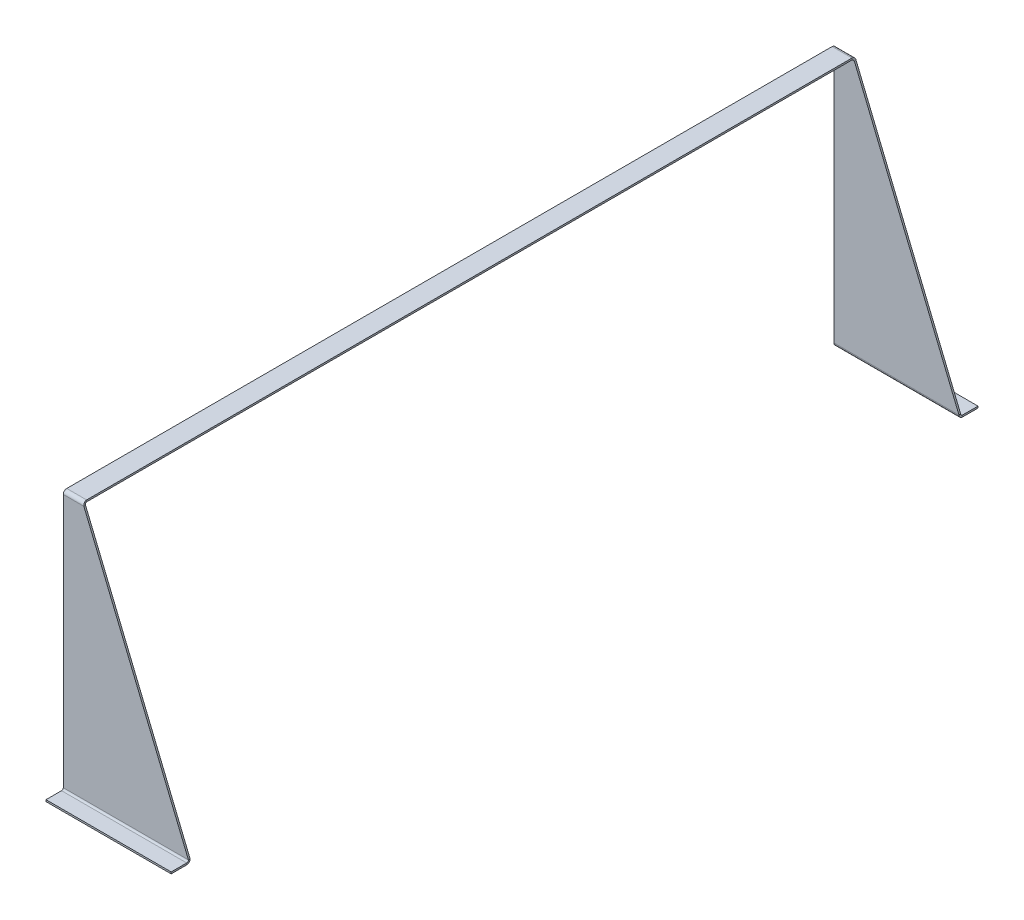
ISO-10303-21;
HEADER;
FILE_DESCRIPTION(('STEP AP214'),'2;1');
FILE_NAME('part.step','',(''),(''),'','','');
FILE_SCHEMA(('AUTOMOTIVE_DESIGN { 1 0 10303 214 1 1 1 1 }'));
ENDSEC;
DATA;
#1=APPLICATION_CONTEXT('core data for automotive mechanical design processes');
#2=APPLICATION_PROTOCOL_DEFINITION('international standard','automotive_design',2000,#1);
#3=PRODUCT_CONTEXT('',#1,'mechanical');
#4=PRODUCT('Part','Part','',(#3));
#5=PRODUCT_RELATED_PRODUCT_CATEGORY('part','',(#4));
#6=PRODUCT_DEFINITION_FORMATION('','',#4);
#7=PRODUCT_DEFINITION_CONTEXT('part definition',#1,'design');
#8=PRODUCT_DEFINITION('design','',#6,#7);
#9=PRODUCT_DEFINITION_SHAPE('','',#8);
#10=(LENGTH_UNIT() NAMED_UNIT(*) SI_UNIT(.MILLI.,.METRE.));
#11=(NAMED_UNIT(*) PLANE_ANGLE_UNIT() SI_UNIT($,.RADIAN.));
#12=(NAMED_UNIT(*) SI_UNIT($,.STERADIAN.) SOLID_ANGLE_UNIT());
#13=UNCERTAINTY_MEASURE_WITH_UNIT(LENGTH_MEASURE(1.E-05),#10,'distance_accuracy_value','');
#14=(GEOMETRIC_REPRESENTATION_CONTEXT(3) GLOBAL_UNCERTAINTY_ASSIGNED_CONTEXT((#13)) GLOBAL_UNIT_ASSIGNED_CONTEXT((#10,
#11,#12)) REPRESENTATION_CONTEXT('',''));
#15=CARTESIAN_POINT('',(0.,0.,0.));
#16=DIRECTION('',(0.,0.,1.));
#17=DIRECTION('',(1.,0.,0.));
#18=AXIS2_PLACEMENT_3D('',#15,#16,#17);
#19=CARTESIAN_POINT('',(-26.9151478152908,93.9999999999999,444.999999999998));
#20=DIRECTION('',(-0.999999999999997,0.,0.));
#21=DIRECTION('',(0.,0.,-0.999999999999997));
#22=AXIS2_PLACEMENT_3D('',#19,#20,#21);
#23=PLANE('',#22);
#24=DIRECTION('',(0.,1.,0.));
#25=VECTOR('',#24,1.);
#26=CARTESIAN_POINT('',(-26.9151478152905,93.9999999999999,1.));
#27=LINE('',#26,#25);
#28=CARTESIAN_POINT('',(-26.9151478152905,93.9999999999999,1.));
#29=VERTEX_POINT('',#28);
#30=CARTESIAN_POINT('',(-26.9151478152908,94.9999999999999,1.));
#31=VERTEX_POINT('',#30);
#32=EDGE_CURVE('E13',#29,#31,#27,.T.);
#33=ORIENTED_EDGE('',*,*,#32,.F.);
#34=DIRECTION('',(0.,0.,-0.999999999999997));
#35=VECTOR('',#34,1.);
#36=CARTESIAN_POINT('',(-26.9151478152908,93.9999999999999,444.999999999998));
#37=LINE('',#36,#35);
#38=CARTESIAN_POINT('',(-26.9151478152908,93.9999999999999,443.999999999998));
#39=VERTEX_POINT('',#38);
#40=EDGE_CURVE('E371',#39,#29,#37,.T.);
#41=ORIENTED_EDGE('',*,*,#40,.F.);
#42=DIRECTION('',(0.,1.,0.));
#43=VECTOR('',#42,1.);
#44=CARTESIAN_POINT('',(-26.9151478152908,93.9999999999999,443.999999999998));
#45=LINE('',#44,#43);
#46=CARTESIAN_POINT('',(-26.9151478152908,94.9999999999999,443.999999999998));
#47=VERTEX_POINT('',#46);
#48=EDGE_CURVE('E84',#39,#47,#45,.T.);
#49=ORIENTED_EDGE('',*,*,#48,.T.);
#50=DIRECTION('',(0.,0.,-0.999999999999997));
#51=VECTOR('',#50,1.);
#52=CARTESIAN_POINT('',(-26.9151478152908,94.9999999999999,444.999999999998));
#53=LINE('',#52,#51);
#54=EDGE_CURVE('E345',#47,#31,#53,.T.);
#55=ORIENTED_EDGE('',*,*,#54,.T.);
#56=EDGE_LOOP('',(#33,#41,#49,#55));
#57=FACE_BOUND('',#56,.T.);
#58=ADVANCED_FACE('F74',(#57),#23,.T.);
#59=CARTESIAN_POINT('',(-26.9151478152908,92.9999999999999,443.999999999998));
#60=DIRECTION('',(-0.999999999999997,0.,0.));
#61=DIRECTION('',(0.,-1.,0.));
#62=AXIS2_PLACEMENT_3D('',#59,#60,#61);
#63=PLANE('',#62);
#64=ORIENTED_EDGE('',*,*,#48,.F.);
#65=CARTESIAN_POINT('',(-26.9151478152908,92.9999999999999,443.999999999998));
#66=DIRECTION('',(0.999999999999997,0.,0.));
#67=DIRECTION('',(0.,1.,0.));
#68=AXIS2_PLACEMENT_3D('',#65,#66,#67);
#69=CIRCLE('',#68,1.);
#70=CARTESIAN_POINT('',(-26.9151478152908,92.9999999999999,444.999999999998));
#71=VERTEX_POINT('',#70);
#72=EDGE_CURVE('E309',#39,#71,#69,.T.);
#73=ORIENTED_EDGE('',*,*,#72,.T.);
#74=DIRECTION('',(0.,0.,0.999999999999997));
#75=VECTOR('',#74,1.);
#76=CARTESIAN_POINT('',(-26.9151478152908,92.9999999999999,444.999999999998));
#77=LINE('',#76,#75);
#78=CARTESIAN_POINT('',(-26.9151478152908,92.9999999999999,445.999999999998));
#79=VERTEX_POINT('',#78);
#80=EDGE_CURVE('E421',#71,#79,#77,.T.);
#81=ORIENTED_EDGE('',*,*,#80,.T.);
#82=CARTESIAN_POINT('',(-26.9151478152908,92.9999999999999,443.999999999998));
#83=DIRECTION('',(-0.999999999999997,0.,0.));
#84=DIRECTION('',(0.,0.,0.999999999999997));
#85=AXIS2_PLACEMENT_3D('',#82,#83,#84);
#86=CIRCLE('',#85,2.);
#87=EDGE_CURVE('E349',#47,#79,#86,.F.);
#88=ORIENTED_EDGE('',*,*,#87,.F.);
#89=EDGE_LOOP('',(#64,#73,#81,#88));
#90=FACE_BOUND('',#89,.T.);
#91=ADVANCED_FACE('F424',(#90),#63,.T.);
#92=CARTESIAN_POINT('',(-26.9151478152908,93.9999999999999,444.999999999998));
#93=DIRECTION('',(0.999999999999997,0.,0.));
#94=DIRECTION('',(0.,-1.,0.));
#95=AXIS2_PLACEMENT_3D('',#92,#93,#94);
#96=PLANE('',#95);
#97=ORIENTED_EDGE('',*,*,#80,.F.);
#98=DIRECTION('',(0.,-1.,0.));
#99=VECTOR('',#98,1.);
#100=CARTESIAN_POINT('',(-26.9151478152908,93.9999999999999,444.999999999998));
#101=LINE('',#100,#99);
#102=CARTESIAN_POINT('',(-26.9151478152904,-53.9999999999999,444.999999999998));
#103=VERTEX_POINT('',#102);
#104=EDGE_CURVE('E368',#71,#103,#101,.T.);
#105=ORIENTED_EDGE('',*,*,#104,.T.);
#106=DIRECTION('',(0.,0.,0.999999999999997));
#107=VECTOR('',#106,1.);
#108=CARTESIAN_POINT('',(-26.9151478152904,-53.9999999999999,444.999999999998));
#109=LINE('',#108,#107);
#110=CARTESIAN_POINT('',(-26.9151478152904,-53.9999999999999,445.999999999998));
#111=VERTEX_POINT('',#110);
#112=EDGE_CURVE('E419',#103,#111,#109,.T.);
#113=ORIENTED_EDGE('',*,*,#112,.T.);
#114=DIRECTION('',(0.,1.,0.));
#115=VECTOR('',#114,1.);
#116=CARTESIAN_POINT('',(-26.9151478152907,1.11022302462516E-13,445.999999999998));
#117=LINE('',#116,#115);
#118=EDGE_CURVE('E352',#79,#111,#117,.F.);
#119=ORIENTED_EDGE('',*,*,#118,.F.);
#120=EDGE_LOOP('',(#97,#105,#113,#119));
#121=FACE_BOUND('',#120,.T.);
#122=ADVANCED_FACE('F432',(#121),#96,.F.);
#123=CARTESIAN_POINT('',(-15.4151478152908,93.9999999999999,444.999999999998));
#124=DIRECTION('',(-0.92467809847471,-0.380749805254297,0.));
#125=DIRECTION('',(-0.380749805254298,0.924678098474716,0.));
#126=AXIS2_PLACEMENT_3D('',#123,#124,#125);
#127=PLANE('',#126);
#128=DIRECTION('',(0.,0.,0.999999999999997));
#129=VECTOR('',#128,1.);
#130=CARTESIAN_POINT('',(45.526028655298,-53.9999999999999,444.999999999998));
#131=LINE('',#130,#129);
#132=CARTESIAN_POINT('',(45.526028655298,-53.9999999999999,444.999999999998));
#133=VERTEX_POINT('',#132);
#134=CARTESIAN_POINT('',(45.526028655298,-53.9999999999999,445.999999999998));
#135=VERTEX_POINT('',#134);
#136=EDGE_CURVE('E416',#133,#135,#131,.T.);
#137=ORIENTED_EDGE('',*,*,#136,.F.);
#138=DIRECTION('',(-0.380749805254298,0.924678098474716,0.));
#139=VECTOR('',#138,1.);
#140=CARTESIAN_POINT('',(-15.4151478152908,93.9999999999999,444.999999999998));
#141=LINE('',#140,#139);
#142=CARTESIAN_POINT('',(-15.0033831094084,92.9999999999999,444.999999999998));
#143=VERTEX_POINT('',#142);
#144=EDGE_CURVE('E364',#133,#143,#141,.T.);
#145=ORIENTED_EDGE('',*,*,#144,.T.);
#146=DIRECTION('',(0.,0.,0.999999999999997));
#147=VECTOR('',#146,1.);
#148=CARTESIAN_POINT('',(-15.0033831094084,92.9999999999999,444.999999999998));
#149=LINE('',#148,#147);
#150=CARTESIAN_POINT('',(-15.0033831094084,92.9999999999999,445.999999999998));
#151=VERTEX_POINT('',#150);
#152=EDGE_CURVE('E414',#143,#151,#149,.T.);
#153=ORIENTED_EDGE('',*,*,#152,.T.);
#154=DIRECTION('',(-0.380749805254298,0.924678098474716,0.));
#155=VECTOR('',#154,1.);
#156=CARTESIAN_POINT('',(-15.4151478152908,93.9999999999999,445.999999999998));
#157=LINE('',#156,#155);
#158=EDGE_CURVE('E350',#135,#151,#157,.T.);
#159=ORIENTED_EDGE('',*,*,#158,.F.);
#160=EDGE_LOOP('',(#137,#145,#153,#159));
#161=FACE_BOUND('',#160,.T.);
#162=ADVANCED_FACE('F510',(#161),#127,.F.);
#163=CARTESIAN_POINT('',(-15.415147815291,94.9999999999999,443.999999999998));
#164=CARTESIAN_POINT('',(-15.415147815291,94.6666666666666,443.999999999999));
#165=CARTESIAN_POINT('',(-15.4151478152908,94.3333333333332,443.999999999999));
#166=CARTESIAN_POINT('',(-15.4151478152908,93.9999999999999,443.999999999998));
#167=CARTESIAN_POINT('',(-15.4151478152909,95.,439.999999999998));
#168=CARTESIAN_POINT('',(-15.415147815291,94.6666666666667,440.666666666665));
#169=CARTESIAN_POINT('',(-15.415147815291,94.3333333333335,441.333333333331));
#170=CARTESIAN_POINT('',(-15.4151478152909,94.0000000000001,441.999999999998));
#171=CARTESIAN_POINT('',(-14.5916184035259,91.,439.999999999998));
#172=CARTESIAN_POINT('',(-14.5916184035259,91.3333333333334,440.666666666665));
#173=CARTESIAN_POINT('',(-14.5916184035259,91.6666666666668,441.333333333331));
#174=CARTESIAN_POINT('',(-14.5916184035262,92.0000000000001,441.999999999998));
#175=CARTESIAN_POINT('',(-14.591618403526,90.9999999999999,443.999999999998));
#176=CARTESIAN_POINT('',(-14.591618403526,91.3333333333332,443.999999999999));
#177=CARTESIAN_POINT('',(-14.591618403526,91.6666666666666,443.999999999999));
#178=CARTESIAN_POINT('',(-14.591618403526,91.9999999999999,443.999999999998));
#179=CARTESIAN_POINT('',(-14.5916184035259,91.0000000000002,447.999999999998));
#180=CARTESIAN_POINT('',(-14.5916184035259,91.3333333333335,447.333333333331));
#181=CARTESIAN_POINT('',(-14.5916184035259,91.6666666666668,446.666666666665));
#182=CARTESIAN_POINT('',(-14.5916184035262,92.0000000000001,445.999999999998));
#183=CARTESIAN_POINT('',(-15.4151478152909,95.0000000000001,447.999999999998));
#184=CARTESIAN_POINT('',(-15.415147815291,94.6666666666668,447.333333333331));
#185=CARTESIAN_POINT('',(-15.415147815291,94.3333333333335,446.666666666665));
#186=CARTESIAN_POINT('',(-15.4151478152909,94.0000000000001,445.999999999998));
#187=CARTESIAN_POINT('',(-15.415147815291,94.9999999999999,443.999999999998));
#188=CARTESIAN_POINT('',(-15.415147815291,94.6666666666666,443.999999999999));
#189=CARTESIAN_POINT('',(-15.4151478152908,94.3333333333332,443.999999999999));
#190=CARTESIAN_POINT('',(-15.4151478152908,93.9999999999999,443.999999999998));
#191=(BOUNDED_SURFACE() B_SPLINE_SURFACE(3,3,((#163,#164,#165,#166),(#167,#168,#169,#170),(#171,
#172,#173,#174),(#175,#176,#177,#178),(#179,#180,#181,#182),(#183,#184,#185,#186),(#187,#188,
#189,#190)),.UNSPECIFIED.,.T.,.F.,.F.) B_SPLINE_SURFACE_WITH_KNOTS((4,3,4),(4,4),(0.,0.5,1.),
(0.,1.),.UNSPECIFIED.) GEOMETRIC_REPRESENTATION_ITEM() RATIONAL_B_SPLINE_SURFACE(((1.,1.,1.,1.),
(0.333333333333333,0.333333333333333,0.333333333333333,0.333333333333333),(0.333333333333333,
0.333333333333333,0.333333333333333,0.333333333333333),(1.,1.,1.,1.),(0.333333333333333,
0.333333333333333,0.333333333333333,0.333333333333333),(0.333333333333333,0.333333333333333,
0.333333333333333,0.333333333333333),(1.,1.,1.,1.))) REPRESENTATION_ITEM('') SURFACE());
#192=CARTESIAN_POINT('',(-15.0033831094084,92.9999999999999,443.999999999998));
#193=DIRECTION('',(0.92467809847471,0.380749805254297,0.));
#194=DIRECTION('',(-0.380749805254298,0.924678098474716,0.));
#195=AXIS2_PLACEMENT_3D('',#192,#193,#194);
#196=ELLIPSE('',#195,1.08145743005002,1.);
#197=CARTESIAN_POINT('',(-15.4151478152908,93.9999999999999,443.999999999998));
#198=VERTEX_POINT('',#197);
#199=EDGE_CURVE('E395',#143,#198,#196,.F.);
#200=DIRECTION('',(0.,1.,0.));
#201=VECTOR('',#200,1.);
#202=CARTESIAN_POINT('',(-15.4151478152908,93.9999999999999,443.999999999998));
#203=LINE('',#202,#201);
#204=CARTESIAN_POINT('',(-15.415147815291,94.9999999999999,443.999999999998));
#205=VERTEX_POINT('',#204);
#206=EDGE_CURVE('E136',#198,#205,#203,.T.);
#207=CARTESIAN_POINT('',(-15.0033831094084,92.9999999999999,443.999999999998));
#208=DIRECTION('',(0.979457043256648,0.201652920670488,0.));
#209=DIRECTION('',(-0.20165292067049,0.979457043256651,0.));
#210=AXIS2_PLACEMENT_3D('',#207,#208,#209);
#211=ELLIPSE('',#210,2.04194764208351,2.);
#212=EDGE_CURVE('E346',#151,#205,#211,.F.);
#213=ORIENTED_EDGE('',*,*,#152,.F.);
#214=ORIENTED_EDGE('',*,*,#199,.T.);
#215=ORIENTED_EDGE('',*,*,#206,.T.);
#216=ORIENTED_EDGE('',*,*,#212,.F.);
#217=EDGE_LOOP('',(#213,#214,#215,#216));
#218=FACE_BOUND('',#217,.T.);
#219=ADVANCED_FACE('F439',(#218),#191,.F.);
#220=CARTESIAN_POINT('',(-15.4151478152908,93.9999999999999,444.999999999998));
#221=DIRECTION('',(-0.999999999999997,0.,0.));
#222=DIRECTION('',(0.,0.,-0.999999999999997));
#223=AXIS2_PLACEMENT_3D('',#220,#221,#222);
#224=PLANE('',#223);
#225=ORIENTED_EDGE('',*,*,#206,.F.);
#226=DIRECTION('',(0.,0.,-0.999999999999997));
#227=VECTOR('',#226,1.);
#228=CARTESIAN_POINT('',(-15.4151478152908,93.9999999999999,444.999999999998));
#229=LINE('',#228,#227);
#230=CARTESIAN_POINT('',(-15.4151478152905,94.,1.));
#231=VERTEX_POINT('',#230);
#232=EDGE_CURVE('E374',#198,#231,#229,.T.);
#233=ORIENTED_EDGE('',*,*,#232,.T.);
#234=DIRECTION('',(0.,1.,0.));
#235=VECTOR('',#234,1.);
#236=CARTESIAN_POINT('',(-15.4151478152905,94.,1.));
#237=LINE('',#236,#235);
#238=CARTESIAN_POINT('',(-15.4151478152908,95.,1.));
#239=VERTEX_POINT('',#238);
#240=EDGE_CURVE('E411',#231,#239,#237,.T.);
#241=ORIENTED_EDGE('',*,*,#240,.T.);
#242=DIRECTION('',(0.,0.,-0.999999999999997));
#243=VECTOR('',#242,1.);
#244=CARTESIAN_POINT('',(-15.415147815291,94.9999999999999,444.999999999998));
#245=LINE('',#244,#243);
#246=EDGE_CURVE('E336',#205,#239,#245,.T.);
#247=ORIENTED_EDGE('',*,*,#246,.F.);
#248=EDGE_LOOP('',(#225,#233,#241,#247));
#249=FACE_BOUND('',#248,.T.);
#250=ADVANCED_FACE('F441',(#249),#224,.F.);
#251=CARTESIAN_POINT('',(-14.5916184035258,92.,1.));
#252=CARTESIAN_POINT('',(-14.5916184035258,91.6666666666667,1.));
#253=CARTESIAN_POINT('',(-14.5916184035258,91.3333333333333,1.));
#254=CARTESIAN_POINT('',(-14.5916184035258,91.,1.));
#255=CARTESIAN_POINT('',(-14.5916184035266,92.,2.99999999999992));
#256=CARTESIAN_POINT('',(-14.5916184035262,91.6666666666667,3.66666666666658));
#257=CARTESIAN_POINT('',(-14.5916184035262,91.3333333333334,4.33333333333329));
#258=CARTESIAN_POINT('',(-14.5916184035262,91.0000000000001,4.99999999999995));
#259=CARTESIAN_POINT('',(-15.4151478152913,94.,2.99999999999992));
#260=CARTESIAN_POINT('',(-15.4151478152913,94.3333333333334,3.66666666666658));
#261=CARTESIAN_POINT('',(-15.4151478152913,94.6666666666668,4.33333333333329));
#262=CARTESIAN_POINT('',(-15.4151478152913,95.0000000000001,4.99999999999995));
#263=CARTESIAN_POINT('',(-15.4151478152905,94.,1.));
#264=CARTESIAN_POINT('',(-15.4151478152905,94.3333333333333,1.));
#265=CARTESIAN_POINT('',(-15.4151478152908,94.6666666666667,1.));
#266=CARTESIAN_POINT('',(-15.4151478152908,95.,1.));
#267=CARTESIAN_POINT('',(-15.4151478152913,94.,-1.00000000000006));
#268=CARTESIAN_POINT('',(-15.4151478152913,94.3333333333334,-1.66666666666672));
#269=CARTESIAN_POINT('',(-15.4151478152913,94.6666666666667,-2.33333333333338));
#270=CARTESIAN_POINT('',(-15.4151478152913,95.,-3.00000000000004));
#271=CARTESIAN_POINT('',(-14.5916184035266,92.,-1.00000000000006));
#272=CARTESIAN_POINT('',(-14.5916184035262,91.6666666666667,-1.66666666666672));
#273=CARTESIAN_POINT('',(-14.5916184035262,91.3333333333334,-2.33333333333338));
#274=CARTESIAN_POINT('',(-14.5916184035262,91.,-3.00000000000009));
#275=CARTESIAN_POINT('',(-14.5916184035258,92.,1.));
#276=CARTESIAN_POINT('',(-14.5916184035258,91.6666666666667,1.));
#277=CARTESIAN_POINT('',(-14.5916184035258,91.3333333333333,1.));
#278=CARTESIAN_POINT('',(-14.5916184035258,91.,1.));
#279=(BOUNDED_SURFACE() B_SPLINE_SURFACE(3,3,((#251,#252,#253,#254),(#255,#256,#257,#258),(#259,
#260,#261,#262),(#263,#264,#265,#266),(#267,#268,#269,#270),(#271,#272,#273,#274),(#275,#276,
#277,#278)),.UNSPECIFIED.,.T.,.F.,.F.) B_SPLINE_SURFACE_WITH_KNOTS((4,3,4),(4,4),(0.,0.5,1.),
(0.,1.),.UNSPECIFIED.) GEOMETRIC_REPRESENTATION_ITEM() RATIONAL_B_SPLINE_SURFACE(((1.,1.,1.,1.),
(0.333333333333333,0.333333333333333,0.333333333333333,0.333333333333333),(0.333333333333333,
0.333333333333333,0.333333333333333,0.333333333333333),(1.,1.,1.,1.),(0.333333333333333,
0.333333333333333,0.333333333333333,0.333333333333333),(0.333333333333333,0.333333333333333,
0.333333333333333,0.333333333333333),(1.,1.,1.,1.))) REPRESENTATION_ITEM('') SURFACE());
#280=CARTESIAN_POINT('',(-15.0033831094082,93.,1.));
#281=DIRECTION('',(-0.92467809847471,-0.380749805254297,0.));
#282=DIRECTION('',(0.380749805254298,-0.924678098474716,0.));
#283=AXIS2_PLACEMENT_3D('',#280,#281,#282);
#284=ELLIPSE('',#283,1.08145743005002,1.);
#285=CARTESIAN_POINT('',(-15.0033831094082,93.,0.));
#286=VERTEX_POINT('',#285);
#287=EDGE_CURVE('E365',#231,#286,#284,.T.);
#288=DIRECTION('',(0.,0.,-0.999999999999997));
#289=VECTOR('',#288,1.);
#290=CARTESIAN_POINT('',(-15.0033831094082,93.,0.));
#291=LINE('',#290,#289);
#292=CARTESIAN_POINT('',(-15.0033831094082,93.,-1.));
#293=VERTEX_POINT('',#292);
#294=EDGE_CURVE('E409',#286,#293,#291,.T.);
#295=CARTESIAN_POINT('',(-15.0033831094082,93.,1.));
#296=DIRECTION('',(-0.979457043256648,-0.201652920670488,0.));
#297=DIRECTION('',(0.20165292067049,-0.979457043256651,0.));
#298=AXIS2_PLACEMENT_3D('',#295,#296,#297);
#299=ELLIPSE('',#298,2.04194764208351,2.);
#300=EDGE_CURVE('E339',#239,#293,#299,.T.);
#301=ORIENTED_EDGE('',*,*,#240,.F.);
#302=ORIENTED_EDGE('',*,*,#287,.T.);
#303=ORIENTED_EDGE('',*,*,#294,.T.);
#304=ORIENTED_EDGE('',*,*,#300,.F.);
#305=EDGE_LOOP('',(#301,#302,#303,#304));
#306=FACE_BOUND('',#305,.T.);
#307=ADVANCED_FACE('F465',(#306),#279,.T.);
#308=CARTESIAN_POINT('',(-15.4151478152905,94.,0.));
#309=DIRECTION('',(-0.92467809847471,-0.380749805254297,0.));
#310=DIRECTION('',(-0.380749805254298,0.924678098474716,0.));
#311=AXIS2_PLACEMENT_3D('',#308,#309,#310);
#312=PLANE('',#311);
#313=ORIENTED_EDGE('',*,*,#294,.F.);
#314=DIRECTION('',(-0.380749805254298,0.924678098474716,0.));
#315=VECTOR('',#314,1.);
#316=CARTESIAN_POINT('',(-15.4151478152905,94.,0.));
#317=LINE('',#316,#315);
#318=CARTESIAN_POINT('',(45.5260286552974,-54.0000000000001,0.));
#319=VERTEX_POINT('',#318);
#320=EDGE_CURVE('E382',#319,#286,#317,.T.);
#321=ORIENTED_EDGE('',*,*,#320,.F.);
#322=DIRECTION('',(0.,0.,-0.999999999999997));
#323=VECTOR('',#322,1.);
#324=CARTESIAN_POINT('',(45.5260286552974,-54.0000000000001,0.));
#325=LINE('',#324,#323);
#326=CARTESIAN_POINT('',(45.5260286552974,-54.0000000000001,-1.00000000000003));
#327=VERTEX_POINT('',#326);
#328=EDGE_CURVE('E406',#319,#327,#325,.T.);
#329=ORIENTED_EDGE('',*,*,#328,.T.);
#330=DIRECTION('',(-0.380749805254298,0.924678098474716,0.));
#331=VECTOR('',#330,1.);
#332=CARTESIAN_POINT('',(-15.4151478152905,93.9999999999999,-1.));
#333=LINE('',#332,#331);
#334=EDGE_CURVE('E325',#327,#293,#333,.T.);
#335=ORIENTED_EDGE('',*,*,#334,.T.);
#336=EDGE_LOOP('',(#313,#321,#329,#335));
#337=FACE_BOUND('',#336,.T.);
#338=ADVANCED_FACE('F493',(#337),#312,.F.);
#339=CARTESIAN_POINT('',(-26.9151478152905,93.9999999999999,0.));
#340=DIRECTION('',(0.999999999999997,0.,0.));
#341=DIRECTION('',(0.,-1.,0.));
#342=AXIS2_PLACEMENT_3D('',#339,#340,#341);
#343=PLANE('',#342);
#344=DIRECTION('',(0.,0.,-0.999999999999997));
#345=VECTOR('',#344,1.);
#346=CARTESIAN_POINT('',(-26.9151478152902,-54.,0.));
#347=LINE('',#346,#345);
#348=CARTESIAN_POINT('',(-26.9151478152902,-54.,0.));
#349=VERTEX_POINT('',#348);
#350=CARTESIAN_POINT('',(-26.9151478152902,-54.,-1.00000000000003));
#351=VERTEX_POINT('',#350);
#352=EDGE_CURVE('E404',#349,#351,#347,.T.);
#353=ORIENTED_EDGE('',*,*,#352,.F.);
#354=DIRECTION('',(0.,-1.,0.));
#355=VECTOR('',#354,1.);
#356=CARTESIAN_POINT('',(-26.9151478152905,93.9999999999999,0.));
#357=LINE('',#356,#355);
#358=CARTESIAN_POINT('',(-26.9151478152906,92.9999999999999,0.));
#359=VERTEX_POINT('',#358);
#360=EDGE_CURVE('E379',#359,#349,#357,.T.);
#361=ORIENTED_EDGE('',*,*,#360,.F.);
#362=DIRECTION('',(0.,0.,-0.999999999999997));
#363=VECTOR('',#362,1.);
#364=CARTESIAN_POINT('',(-26.9151478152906,92.9999999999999,0.));
#365=LINE('',#364,#363);
#366=CARTESIAN_POINT('',(-26.9151478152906,92.9999999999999,-1.));
#367=VERTEX_POINT('',#366);
#368=EDGE_CURVE('E78',#359,#367,#365,.T.);
#369=ORIENTED_EDGE('',*,*,#368,.T.);
#370=DIRECTION('',(0.,1.,0.));
#371=VECTOR('',#370,1.);
#372=CARTESIAN_POINT('',(-26.9151478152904,0.,-1.));
#373=LINE('',#372,#371);
#374=EDGE_CURVE('E331',#367,#351,#373,.F.);
#375=ORIENTED_EDGE('',*,*,#374,.T.);
#376=EDGE_LOOP('',(#353,#361,#369,#375));
#377=FACE_BOUND('',#376,.T.);
#378=ADVANCED_FACE('F473',(#377),#343,.F.);
#379=CARTESIAN_POINT('',(-26.9151478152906,92.9999999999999,1.));
#380=DIRECTION('',(0.999999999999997,0.,0.));
#381=DIRECTION('',(0.,1.,0.));
#382=AXIS2_PLACEMENT_3D('',#379,#380,#381);
#383=PLANE('',#382);
#384=CARTESIAN_POINT('',(-26.9151478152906,92.9999999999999,1.));
#385=DIRECTION('',(-0.999999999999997,0.,0.));
#386=DIRECTION('',(0.,-1.,0.));
#387=AXIS2_PLACEMENT_3D('',#384,#385,#386);
#388=CIRCLE('',#387,1.);
#389=EDGE_CURVE('E392',#359,#29,#388,.F.);
#390=ORIENTED_EDGE('',*,*,#389,.T.);
#391=ORIENTED_EDGE('',*,*,#32,.T.);
#392=CARTESIAN_POINT('',(-26.9151478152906,92.9999999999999,1.));
#393=DIRECTION('',(0.999999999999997,0.,0.));
#394=DIRECTION('',(0.,0.,-0.999999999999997));
#395=AXIS2_PLACEMENT_3D('',#392,#393,#394);
#396=CIRCLE('',#395,2.);
#397=EDGE_CURVE('E342',#367,#31,#396,.T.);
#398=ORIENTED_EDGE('',*,*,#397,.F.);
#399=ORIENTED_EDGE('',*,*,#368,.F.);
#400=EDGE_LOOP('',(#390,#391,#398,#399));
#401=FACE_BOUND('',#400,.T.);
#402=ADVANCED_FACE('F76',(#401),#383,.F.);
#403=CARTESIAN_POINT('',(0.,0.,-1.));
#404=DIRECTION('',(0.,0.,-0.999999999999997));
#405=DIRECTION('',(-0.999999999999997,0.,0.));
#406=AXIS2_PLACEMENT_3D('',#403,#404,#405);
#407=PLANE('',#406);
#408=ORIENTED_EDGE('',*,*,#374,.F.);
#409=DIRECTION('',(-0.999999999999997,0.,0.));
#410=VECTOR('',#409,1.);
#411=CARTESIAN_POINT('',(-1.11022302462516E-13,93.,-1.));
#412=LINE('',#411,#410);
#413=EDGE_CURVE('E318',#367,#293,#412,.F.);
#414=ORIENTED_EDGE('',*,*,#413,.T.);
#415=ORIENTED_EDGE('',*,*,#334,.F.);
#416=DIRECTION('',(-0.999999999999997,0.,0.));
#417=VECTOR('',#416,1.);
#418=CARTESIAN_POINT('',(-6.66133814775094E-13,-54.,-1.));
#419=LINE('',#418,#417);
#420=EDGE_CURVE('E334',#351,#327,#419,.F.);
#421=ORIENTED_EDGE('',*,*,#420,.F.);
#422=EDGE_LOOP('',(#408,#414,#415,#421));
#423=FACE_BOUND('',#422,.T.);
#424=ADVANCED_FACE('F470',(#423),#407,.T.);
#425=CARTESIAN_POINT('',(-15.415147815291,94.9999999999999,444.999999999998));
#426=DIRECTION('',(0.,-1.,0.));
#427=DIRECTION('',(0.,0.,-0.999999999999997));
#428=AXIS2_PLACEMENT_3D('',#425,#426,#427);
#429=PLANE('',#428);
#430=ORIENTED_EDGE('',*,*,#54,.F.);
#431=DIRECTION('',(0.999999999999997,0.,0.));
#432=VECTOR('',#431,1.);
#433=CARTESIAN_POINT('',(-15.415147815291,94.9999999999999,443.999999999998));
#434=LINE('',#433,#432);
#435=EDGE_CURVE('E326',#47,#205,#434,.T.);
#436=ORIENTED_EDGE('',*,*,#435,.T.);
#437=ORIENTED_EDGE('',*,*,#246,.T.);
#438=DIRECTION('',(0.999999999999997,0.,0.));
#439=VECTOR('',#438,1.);
#440=CARTESIAN_POINT('',(-15.4151478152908,95.,1.));
#441=LINE('',#440,#439);
#442=EDGE_CURVE('E322',#239,#31,#441,.F.);
#443=ORIENTED_EDGE('',*,*,#442,.T.);
#444=EDGE_LOOP('',(#430,#436,#437,#443));
#445=FACE_BOUND('',#444,.T.);
#446=ADVANCED_FACE('F444',(#445),#429,.F.);
#447=CARTESIAN_POINT('',(4.44089209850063E-13,0.,445.999999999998));
#448=DIRECTION('',(0.,0.,-0.999999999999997));
#449=DIRECTION('',(-0.999999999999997,0.,0.));
#450=AXIS2_PLACEMENT_3D('',#447,#448,#449);
#451=PLANE('',#450);
#452=ORIENTED_EDGE('',*,*,#158,.T.);
#453=DIRECTION('',(-0.999999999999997,0.,0.));
#454=VECTOR('',#453,1.);
#455=CARTESIAN_POINT('',(0.,93.,445.999999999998));
#456=LINE('',#455,#454);
#457=EDGE_CURVE('E321',#151,#79,#456,.T.);
#458=ORIENTED_EDGE('',*,*,#457,.T.);
#459=ORIENTED_EDGE('',*,*,#118,.T.);
#460=DIRECTION('',(-0.999999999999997,0.,0.));
#461=VECTOR('',#460,1.);
#462=CARTESIAN_POINT('',(0.,-53.9999999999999,445.999999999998));
#463=LINE('',#462,#461);
#464=EDGE_CURVE('E149',#111,#135,#463,.F.);
#465=ORIENTED_EDGE('',*,*,#464,.T.);
#466=EDGE_LOOP('',(#452,#458,#459,#465));
#467=FACE_BOUND('',#466,.T.);
#468=ADVANCED_FACE('F434',(#467),#451,.F.);
#469=CARTESIAN_POINT('',(-15.4151478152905,93.,1.));
#470=DIRECTION('',(0.999999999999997,0.,0.));
#471=DIRECTION('',(0.,0.,-0.999999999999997));
#472=AXIS2_PLACEMENT_3D('',#469,#470,#471);
#473=CYLINDRICAL_SURFACE('',#472,2.);
#474=ORIENTED_EDGE('',*,*,#300,.T.);
#475=ORIENTED_EDGE('',*,*,#413,.F.);
#476=ORIENTED_EDGE('',*,*,#397,.T.);
#477=ORIENTED_EDGE('',*,*,#442,.F.);
#478=EDGE_LOOP('',(#474,#475,#476,#477));
#479=FACE_BOUND('',#478,.T.);
#480=ADVANCED_FACE('F467',(#479),#473,.T.);
#481=CARTESIAN_POINT('',(0.,93.,443.999999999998));
#482=DIRECTION('',(-0.999999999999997,0.,0.));
#483=DIRECTION('',(0.,0.,0.999999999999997));
#484=AXIS2_PLACEMENT_3D('',#481,#482,#483);
#485=CYLINDRICAL_SURFACE('',#484,2.);
#486=ORIENTED_EDGE('',*,*,#212,.T.);
#487=ORIENTED_EDGE('',*,*,#435,.F.);
#488=ORIENTED_EDGE('',*,*,#87,.T.);
#489=ORIENTED_EDGE('',*,*,#457,.F.);
#490=EDGE_LOOP('',(#486,#487,#488,#489));
#491=FACE_BOUND('',#490,.T.);
#492=ADVANCED_FACE('F431',(#491),#485,.T.);
#493=CARTESIAN_POINT('',(0.,0.,0.));
#494=DIRECTION('',(0.,0.,-0.999999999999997));
#495=DIRECTION('',(-0.999999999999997,0.,0.));
#496=AXIS2_PLACEMENT_3D('',#493,#494,#495);
#497=PLANE('',#496);
#498=ORIENTED_EDGE('',*,*,#360,.T.);
#499=DIRECTION('',(0.999999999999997,0.,0.));
#500=VECTOR('',#499,1.);
#501=CARTESIAN_POINT('',(-26.9151478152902,-54.,0.));
#502=LINE('',#501,#500);
#503=EDGE_CURVE('E376',#349,#319,#502,.T.);
#504=ORIENTED_EDGE('',*,*,#503,.T.);
#505=ORIENTED_EDGE('',*,*,#320,.T.);
#506=DIRECTION('',(-0.999999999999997,0.,0.));
#507=VECTOR('',#506,1.);
#508=CARTESIAN_POINT('',(-15.4151478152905,93.,0.));
#509=LINE('',#508,#507);
#510=EDGE_CURVE('E388',#359,#286,#509,.F.);
#511=ORIENTED_EDGE('',*,*,#510,.F.);
#512=EDGE_LOOP('',(#498,#504,#505,#511));
#513=FACE_BOUND('',#512,.T.);
#514=ADVANCED_FACE('F462',(#513),#497,.F.);
#515=CARTESIAN_POINT('',(-15.4151478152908,93.9999999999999,444.999999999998));
#516=DIRECTION('',(0.,-1.,0.));
#517=DIRECTION('',(0.,0.,-0.999999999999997));
#518=AXIS2_PLACEMENT_3D('',#515,#516,#517);
#519=PLANE('',#518);
#520=ORIENTED_EDGE('',*,*,#40,.T.);
#521=DIRECTION('',(-0.999999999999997,0.,0.));
#522=VECTOR('',#521,1.);
#523=CARTESIAN_POINT('',(-26.9151478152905,93.9999999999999,1.));
#524=LINE('',#523,#522);
#525=EDGE_CURVE('E385',#231,#29,#524,.T.);
#526=ORIENTED_EDGE('',*,*,#525,.F.);
#527=ORIENTED_EDGE('',*,*,#232,.F.);
#528=DIRECTION('',(-0.999999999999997,0.,0.));
#529=VECTOR('',#528,1.);
#530=CARTESIAN_POINT('',(-15.4151478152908,93.9999999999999,443.999999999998));
#531=LINE('',#530,#529);
#532=EDGE_CURVE('E357',#39,#198,#531,.F.);
#533=ORIENTED_EDGE('',*,*,#532,.F.);
#534=EDGE_LOOP('',(#520,#526,#527,#533));
#535=FACE_BOUND('',#534,.T.);
#536=ADVANCED_FACE('F456',(#535),#519,.T.);
#537=CARTESIAN_POINT('',(4.44089209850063E-13,0.,444.999999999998));
#538=DIRECTION('',(0.,0.,-0.999999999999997));
#539=DIRECTION('',(-0.999999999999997,0.,0.));
#540=AXIS2_PLACEMENT_3D('',#537,#538,#539);
#541=PLANE('',#540);
#542=ORIENTED_EDGE('',*,*,#144,.F.);
#543=DIRECTION('',(0.999999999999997,0.,0.));
#544=VECTOR('',#543,1.);
#545=CARTESIAN_POINT('',(-26.9151478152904,-53.9999999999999,444.999999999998));
#546=LINE('',#545,#544);
#547=EDGE_CURVE('E361',#103,#133,#546,.T.);
#548=ORIENTED_EDGE('',*,*,#547,.F.);
#549=ORIENTED_EDGE('',*,*,#104,.F.);
#550=DIRECTION('',(-0.999999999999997,0.,0.));
#551=VECTOR('',#550,1.);
#552=CARTESIAN_POINT('',(0.,93.,444.999999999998));
#553=LINE('',#552,#551);
#554=EDGE_CURVE('E391',#143,#71,#553,.T.);
#555=ORIENTED_EDGE('',*,*,#554,.F.);
#556=EDGE_LOOP('',(#542,#548,#549,#555));
#557=FACE_BOUND('',#556,.T.);
#558=ADVANCED_FACE('F622',(#557),#541,.T.);
#559=CARTESIAN_POINT('',(-15.4151478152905,93.,1.));
#560=DIRECTION('',(0.999999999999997,0.,0.));
#561=DIRECTION('',(0.,0.,-0.999999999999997));
#562=AXIS2_PLACEMENT_3D('',#559,#560,#561);
#563=CYLINDRICAL_SURFACE('',#562,1.);
#564=ORIENTED_EDGE('',*,*,#287,.F.);
#565=ORIENTED_EDGE('',*,*,#525,.T.);
#566=ORIENTED_EDGE('',*,*,#389,.F.);
#567=ORIENTED_EDGE('',*,*,#510,.T.);
#568=EDGE_LOOP('',(#564,#565,#566,#567));
#569=FACE_BOUND('',#568,.T.);
#570=ADVANCED_FACE('F452',(#569),#563,.F.);
#571=CARTESIAN_POINT('',(0.,93.,443.999999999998));
#572=DIRECTION('',(-0.999999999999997,0.,0.));
#573=DIRECTION('',(0.,0.,0.999999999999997));
#574=AXIS2_PLACEMENT_3D('',#571,#572,#573);
#575=CYLINDRICAL_SURFACE('',#574,1.);
#576=ORIENTED_EDGE('',*,*,#199,.F.);
#577=ORIENTED_EDGE('',*,*,#554,.T.);
#578=ORIENTED_EDGE('',*,*,#72,.F.);
#579=ORIENTED_EDGE('',*,*,#532,.T.);
#580=EDGE_LOOP('',(#576,#577,#578,#579));
#581=FACE_BOUND('',#580,.T.);
#582=ADVANCED_FACE('F639',(#581),#575,.F.);
#583=CARTESIAN_POINT('',(-26.9151478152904,-53.9999999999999,446.999999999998));
#584=DIRECTION('',(-0.999999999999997,0.,0.));
#585=DIRECTION('',(0.,0.,0.999999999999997));
#586=AXIS2_PLACEMENT_3D('',#583,#584,#585);
#587=PLANE('',#586);
#588=DIRECTION('',(0.,1.,0.));
#589=VECTOR('',#588,1.);
#590=CARTESIAN_POINT('',(-26.9151478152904,-55.9999999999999,446.999999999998));
#591=LINE('',#590,#589);
#592=CARTESIAN_POINT('',(-26.9151478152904,-54.9999999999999,446.999999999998));
#593=VERTEX_POINT('',#592);
#594=CARTESIAN_POINT('',(-26.9151478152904,-55.9999999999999,446.999999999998));
#595=VERTEX_POINT('',#594);
#596=EDGE_CURVE('E266',#593,#595,#591,.F.);
#597=ORIENTED_EDGE('',*,*,#596,.F.);
#598=CARTESIAN_POINT('',(-26.9151478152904,-53.9999999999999,446.999999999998));
#599=DIRECTION('',(0.999999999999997,0.,0.));
#600=DIRECTION('',(0.,0.,-0.999999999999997));
#601=AXIS2_PLACEMENT_3D('',#598,#599,#600);
#602=CIRCLE('',#601,1.);
#603=EDGE_CURVE('E313',#111,#593,#602,.F.);
#604=ORIENTED_EDGE('',*,*,#603,.F.);
#605=ORIENTED_EDGE('',*,*,#112,.F.);
#606=CARTESIAN_POINT('',(-26.9151478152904,-53.9999999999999,446.999999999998));
#607=DIRECTION('',(0.999999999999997,0.,0.));
#608=DIRECTION('',(0.,0.,-0.999999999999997));
#609=AXIS2_PLACEMENT_3D('',#606,#607,#608);
#610=CIRCLE('',#609,2.);
#611=EDGE_CURVE('E306',#103,#595,#610,.F.);
#612=ORIENTED_EDGE('',*,*,#611,.T.);
#613=EDGE_LOOP('',(#597,#604,#605,#612));
#614=FACE_BOUND('',#613,.T.);
#615=ADVANCED_FACE('F648',(#614),#587,.T.);
#616=CARTESIAN_POINT('',(45.526028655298,-53.9999999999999,446.999999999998));
#617=DIRECTION('',(-0.999999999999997,0.,0.));
#618=DIRECTION('',(0.,0.,0.999999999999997));
#619=AXIS2_PLACEMENT_3D('',#616,#617,#618);
#620=PLANE('',#619);
#621=CARTESIAN_POINT('',(45.526028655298,-53.9999999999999,446.999999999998));
#622=DIRECTION('',(0.999999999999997,0.,0.));
#623=DIRECTION('',(0.,0.,-0.999999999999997));
#624=AXIS2_PLACEMENT_3D('',#621,#622,#623);
#625=CIRCLE('',#624,1.);
#626=CARTESIAN_POINT('',(45.526028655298,-54.9999999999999,446.999999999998));
#627=VERTEX_POINT('',#626);
#628=EDGE_CURVE('E279',#627,#135,#625,.T.);
#629=ORIENTED_EDGE('',*,*,#628,.F.);
#630=DIRECTION('',(0.,1.,0.));
#631=VECTOR('',#630,1.);
#632=CARTESIAN_POINT('',(45.526028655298,-54.9999999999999,446.999999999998));
#633=LINE('',#632,#631);
#634=CARTESIAN_POINT('',(45.526028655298,-55.9999999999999,446.999999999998));
#635=VERTEX_POINT('',#634);
#636=EDGE_CURVE('E299',#627,#635,#633,.F.);
#637=ORIENTED_EDGE('',*,*,#636,.T.);
#638=CARTESIAN_POINT('',(45.526028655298,-53.9999999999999,446.999999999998));
#639=DIRECTION('',(0.999999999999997,0.,0.));
#640=DIRECTION('',(0.,0.,-0.999999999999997));
#641=AXIS2_PLACEMENT_3D('',#638,#639,#640);
#642=CIRCLE('',#641,2.);
#643=EDGE_CURVE('E310',#635,#133,#642,.T.);
#644=ORIENTED_EDGE('',*,*,#643,.T.);
#645=ORIENTED_EDGE('',*,*,#136,.T.);
#646=EDGE_LOOP('',(#629,#637,#644,#645));
#647=FACE_BOUND('',#646,.T.);
#648=ADVANCED_FACE('F657',(#647),#620,.F.);
#649=CARTESIAN_POINT('',(45.526028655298,-53.9999999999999,446.999999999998));
#650=DIRECTION('',(0.999999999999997,0.,0.));
#651=DIRECTION('',(0.,-1.,0.));
#652=AXIS2_PLACEMENT_3D('',#649,#650,#651);
#653=CYLINDRICAL_SURFACE('',#652,2.);
#654=ORIENTED_EDGE('',*,*,#547,.T.);
#655=ORIENTED_EDGE('',*,*,#643,.F.);
#656=DIRECTION('',(0.999999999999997,0.,0.));
#657=VECTOR('',#656,1.);
#658=CARTESIAN_POINT('',(-26.9151478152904,-55.9999999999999,446.999999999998));
#659=LINE('',#658,#657);
#660=EDGE_CURVE('E297',#635,#595,#659,.F.);
#661=ORIENTED_EDGE('',*,*,#660,.T.);
#662=ORIENTED_EDGE('',*,*,#611,.F.);
#663=EDGE_LOOP('',(#654,#655,#661,#662));
#664=FACE_BOUND('',#663,.T.);
#665=ADVANCED_FACE('F667',(#664),#653,.T.);
#666=CARTESIAN_POINT('',(45.526028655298,-53.9999999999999,446.999999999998));
#667=DIRECTION('',(0.999999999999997,0.,0.));
#668=DIRECTION('',(0.,-1.,0.));
#669=AXIS2_PLACEMENT_3D('',#666,#667,#668);
#670=CYLINDRICAL_SURFACE('',#669,1.);
#671=ORIENTED_EDGE('',*,*,#464,.F.);
#672=ORIENTED_EDGE('',*,*,#603,.T.);
#673=DIRECTION('',(0.999999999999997,0.,0.));
#674=VECTOR('',#673,1.);
#675=CARTESIAN_POINT('',(-26.9151478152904,-54.9999999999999,446.999999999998));
#676=LINE('',#675,#674);
#677=EDGE_CURVE('E302',#593,#627,#676,.T.);
#678=ORIENTED_EDGE('',*,*,#677,.T.);
#679=ORIENTED_EDGE('',*,*,#628,.T.);
#680=EDGE_LOOP('',(#671,#672,#678,#679));
#681=FACE_BOUND('',#680,.T.);
#682=ADVANCED_FACE('F677',(#681),#670,.F.);
#683=CARTESIAN_POINT('',(-26.9151478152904,-55.9999999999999,445.999999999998));
#684=DIRECTION('',(0.999999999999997,0.,0.));
#685=DIRECTION('',(0.,0.,-0.999999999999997));
#686=AXIS2_PLACEMENT_3D('',#683,#684,#685);
#687=PLANE('',#686);
#688=ORIENTED_EDGE('',*,*,#596,.T.);
#689=DIRECTION('',(0.,0.,-0.999999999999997));
#690=VECTOR('',#689,1.);
#691=CARTESIAN_POINT('',(-26.9151478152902,-55.9999999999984,-1.94289029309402E-13));
#692=LINE('',#691,#690);
#693=CARTESIAN_POINT('',(-26.9151478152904,-55.9999999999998,455.999999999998));
#694=VERTEX_POINT('',#693);
#695=EDGE_CURVE('E287',#694,#595,#692,.T.);
#696=ORIENTED_EDGE('',*,*,#695,.F.);
#697=DIRECTION('',(0.,1.,0.));
#698=VECTOR('',#697,1.);
#699=CARTESIAN_POINT('',(-26.9151478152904,-55.9999999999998,455.999999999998));
#700=LINE('',#699,#698);
#701=CARTESIAN_POINT('',(-26.9151478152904,-54.9999999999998,455.999999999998));
#702=VERTEX_POINT('',#701);
#703=EDGE_CURVE('E280',#694,#702,#700,.T.);
#704=ORIENTED_EDGE('',*,*,#703,.T.);
#705=DIRECTION('',(0.,0.,0.999999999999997));
#706=VECTOR('',#705,1.);
#707=CARTESIAN_POINT('',(-26.9151478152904,-54.9999999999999,445.999999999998));
#708=LINE('',#707,#706);
#709=EDGE_CURVE('E294',#702,#593,#708,.F.);
#710=ORIENTED_EDGE('',*,*,#709,.T.);
#711=EDGE_LOOP('',(#688,#696,#704,#710));
#712=FACE_BOUND('',#711,.T.);
#713=ADVANCED_FACE('F687',(#712),#687,.F.);
#714=CARTESIAN_POINT('',(45.5260286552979,-56.,455.999999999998));
#715=DIRECTION('',(-0.999999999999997,0.,0.));
#716=DIRECTION('',(0.,0.,0.999999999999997));
#717=AXIS2_PLACEMENT_3D('',#714,#715,#716);
#718=PLANE('',#717);
#719=ORIENTED_EDGE('',*,*,#636,.F.);
#720=DIRECTION('',(0.,0.,-0.999999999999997));
#721=VECTOR('',#720,1.);
#722=CARTESIAN_POINT('',(45.526028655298,-55.,455.999999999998));
#723=LINE('',#722,#721);
#724=CARTESIAN_POINT('',(45.526028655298,-55.,455.999999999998));
#725=VERTEX_POINT('',#724);
#726=EDGE_CURVE('E292',#627,#725,#723,.F.);
#727=ORIENTED_EDGE('',*,*,#726,.T.);
#728=DIRECTION('',(0.,1.,0.));
#729=VECTOR('',#728,1.);
#730=CARTESIAN_POINT('',(45.526028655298,-56.,455.999999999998));
#731=LINE('',#730,#729);
#732=CARTESIAN_POINT('',(45.526028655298,-56.,455.999999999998));
#733=VERTEX_POINT('',#732);
#734=EDGE_CURVE('E276',#733,#725,#731,.T.);
#735=ORIENTED_EDGE('',*,*,#734,.F.);
#736=DIRECTION('',(0.,0.,0.999999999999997));
#737=VECTOR('',#736,1.);
#738=CARTESIAN_POINT('',(45.5260286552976,-55.9999999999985,-1.94289029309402E-13));
#739=LINE('',#738,#737);
#740=EDGE_CURVE('E285',#635,#733,#739,.T.);
#741=ORIENTED_EDGE('',*,*,#740,.F.);
#742=EDGE_LOOP('',(#719,#727,#735,#741));
#743=FACE_BOUND('',#742,.T.);
#744=ADVANCED_FACE('F697',(#743),#718,.F.);
#745=CARTESIAN_POINT('',(-4.44089209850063E-13,-55.9999999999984,-1.94289029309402E-13));
#746=DIRECTION('',(0.,1.,0.));
#747=DIRECTION('',(0.,0.,0.999999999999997));
#748=AXIS2_PLACEMENT_3D('',#745,#746,#747);
#749=PLANE('',#748);
#750=ORIENTED_EDGE('',*,*,#660,.F.);
#751=ORIENTED_EDGE('',*,*,#740,.T.);
#752=DIRECTION('',(-0.999999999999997,0.,0.));
#753=VECTOR('',#752,1.);
#754=CARTESIAN_POINT('',(0.,-56.,455.999999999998));
#755=LINE('',#754,#753);
#756=EDGE_CURVE('E283',#733,#694,#755,.T.);
#757=ORIENTED_EDGE('',*,*,#756,.T.);
#758=ORIENTED_EDGE('',*,*,#695,.T.);
#759=EDGE_LOOP('',(#750,#751,#757,#758));
#760=FACE_BOUND('',#759,.T.);
#761=ADVANCED_FACE('F707',(#760),#749,.F.);
#762=CARTESIAN_POINT('',(-4.44089209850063E-13,-54.9999999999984,-1.94289029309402E-13));
#763=DIRECTION('',(0.,1.,0.));
#764=DIRECTION('',(0.,0.,0.999999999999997));
#765=AXIS2_PLACEMENT_3D('',#762,#763,#764);
#766=PLANE('',#765);
#767=ORIENTED_EDGE('',*,*,#726,.F.);
#768=ORIENTED_EDGE('',*,*,#677,.F.);
#769=ORIENTED_EDGE('',*,*,#709,.F.);
#770=DIRECTION('',(0.999999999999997,0.,0.));
#771=VECTOR('',#770,1.);
#772=CARTESIAN_POINT('',(-26.9151478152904,-54.9999999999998,455.999999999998));
#773=LINE('',#772,#771);
#774=EDGE_CURVE('E290',#725,#702,#773,.F.);
#775=ORIENTED_EDGE('',*,*,#774,.F.);
#776=EDGE_LOOP('',(#767,#768,#769,#775));
#777=FACE_BOUND('',#776,.T.);
#778=ADVANCED_FACE('F717',(#777),#766,.T.);
#779=CARTESIAN_POINT('',(-26.9151478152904,-55.9999999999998,455.999999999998));
#780=DIRECTION('',(0.,0.,-0.999999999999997));
#781=DIRECTION('',(0.,1.,0.));
#782=AXIS2_PLACEMENT_3D('',#779,#780,#781);
#783=PLANE('',#782);
#784=ORIENTED_EDGE('',*,*,#774,.T.);
#785=ORIENTED_EDGE('',*,*,#703,.F.);
#786=ORIENTED_EDGE('',*,*,#756,.F.);
#787=ORIENTED_EDGE('',*,*,#734,.T.);
#788=EDGE_LOOP('',(#784,#785,#786,#787));
#789=FACE_BOUND('',#788,.T.);
#790=ADVANCED_FACE('F727',(#789),#783,.F.);
#791=CARTESIAN_POINT('',(45.5260286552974,-54.0000000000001,-2.));
#792=DIRECTION('',(0.999999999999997,0.,0.));
#793=DIRECTION('',(0.,0.,-0.999999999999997));
#794=AXIS2_PLACEMENT_3D('',#791,#792,#793);
#795=PLANE('',#794);
#796=DIRECTION('',(0.,1.,0.));
#797=VECTOR('',#796,1.);
#798=CARTESIAN_POINT('',(45.5260286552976,-56.0000000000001,-2.));
#799=LINE('',#798,#797);
#800=CARTESIAN_POINT('',(45.5260286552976,-55.,-2.));
#801=VERTEX_POINT('',#800);
#802=CARTESIAN_POINT('',(45.5260286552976,-56.,-2.));
#803=VERTEX_POINT('',#802);
#804=EDGE_CURVE('E245',#801,#803,#799,.F.);
#805=ORIENTED_EDGE('',*,*,#804,.F.);
#806=CARTESIAN_POINT('',(45.5260286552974,-54.0000000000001,-2.));
#807=DIRECTION('',(-0.999999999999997,0.,0.));
#808=DIRECTION('',(0.,0.,0.999999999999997));
#809=AXIS2_PLACEMENT_3D('',#806,#807,#808);
#810=CIRCLE('',#809,0.999999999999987);
#811=EDGE_CURVE('E270',#327,#801,#810,.F.);
#812=ORIENTED_EDGE('',*,*,#811,.F.);
#813=ORIENTED_EDGE('',*,*,#328,.F.);
#814=CARTESIAN_POINT('',(45.5260286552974,-54.0000000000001,-2.));
#815=DIRECTION('',(-0.999999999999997,0.,0.));
#816=DIRECTION('',(0.,0.,0.999999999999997));
#817=AXIS2_PLACEMENT_3D('',#814,#815,#816);
#818=CIRCLE('',#817,1.99999999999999);
#819=EDGE_CURVE('E263',#319,#803,#818,.F.);
#820=ORIENTED_EDGE('',*,*,#819,.T.);
#821=EDGE_LOOP('',(#805,#812,#813,#820));
#822=FACE_BOUND('',#821,.T.);
#823=ADVANCED_FACE('F491',(#822),#795,.T.);
#824=CARTESIAN_POINT('',(-26.9151478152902,-54.,-2.));
#825=DIRECTION('',(0.999999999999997,0.,0.));
#826=DIRECTION('',(0.,0.,-0.999999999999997));
#827=AXIS2_PLACEMENT_3D('',#824,#825,#826);
#828=PLANE('',#827);
#829=CARTESIAN_POINT('',(-26.9151478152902,-54.,-2.));
#830=DIRECTION('',(-0.999999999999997,0.,0.));
#831=DIRECTION('',(0.,0.,0.999999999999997));
#832=AXIS2_PLACEMENT_3D('',#829,#830,#831);
#833=CIRCLE('',#832,0.999999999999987);
#834=CARTESIAN_POINT('',(-26.9151478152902,-55.,-2.));
#835=VERTEX_POINT('',#834);
#836=EDGE_CURVE('E273',#835,#351,#833,.T.);
#837=ORIENTED_EDGE('',*,*,#836,.F.);
#838=DIRECTION('',(0.,1.,0.));
#839=VECTOR('',#838,1.);
#840=CARTESIAN_POINT('',(-26.9151478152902,-55.,-2.));
#841=LINE('',#840,#839);
#842=CARTESIAN_POINT('',(-26.9151478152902,-56.,-2.));
#843=VERTEX_POINT('',#842);
#844=EDGE_CURVE('E257',#835,#843,#841,.F.);
#845=ORIENTED_EDGE('',*,*,#844,.T.);
#846=CARTESIAN_POINT('',(-26.9151478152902,-54.,-2.));
#847=DIRECTION('',(-0.999999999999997,0.,0.));
#848=DIRECTION('',(0.,0.,0.999999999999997));
#849=AXIS2_PLACEMENT_3D('',#846,#847,#848);
#850=CIRCLE('',#849,1.99999999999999);
#851=EDGE_CURVE('E267',#843,#349,#850,.T.);
#852=ORIENTED_EDGE('',*,*,#851,.T.);
#853=ORIENTED_EDGE('',*,*,#352,.T.);
#854=EDGE_LOOP('',(#837,#845,#852,#853));
#855=FACE_BOUND('',#854,.T.);
#856=ADVANCED_FACE('F476',(#855),#828,.F.);
#857=CARTESIAN_POINT('',(-26.9151478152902,-54.,-2.));
#858=DIRECTION('',(-0.999999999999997,0.,0.));
#859=DIRECTION('',(0.,-1.,0.));
#860=AXIS2_PLACEMENT_3D('',#857,#858,#859);
#861=CYLINDRICAL_SURFACE('',#860,1.99999999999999);
#862=ORIENTED_EDGE('',*,*,#503,.F.);
#863=ORIENTED_EDGE('',*,*,#851,.F.);
#864=DIRECTION('',(-0.999999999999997,0.,0.));
#865=VECTOR('',#864,1.);
#866=CARTESIAN_POINT('',(45.5260286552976,-56.0000000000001,-2.));
#867=LINE('',#866,#865);
#868=EDGE_CURVE('E255',#843,#803,#867,.F.);
#869=ORIENTED_EDGE('',*,*,#868,.T.);
#870=ORIENTED_EDGE('',*,*,#819,.F.);
#871=EDGE_LOOP('',(#862,#863,#869,#870));
#872=FACE_BOUND('',#871,.T.);
#873=ADVANCED_FACE('F488',(#872),#861,.T.);
#874=CARTESIAN_POINT('',(-26.9151478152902,-54.,-2.));
#875=DIRECTION('',(-0.999999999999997,0.,0.));
#876=DIRECTION('',(0.,-1.,0.));
#877=AXIS2_PLACEMENT_3D('',#874,#875,#876);
#878=CYLINDRICAL_SURFACE('',#877,0.999999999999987);
#879=ORIENTED_EDGE('',*,*,#420,.T.);
#880=ORIENTED_EDGE('',*,*,#811,.T.);
#881=DIRECTION('',(-0.999999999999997,0.,0.));
#882=VECTOR('',#881,1.);
#883=CARTESIAN_POINT('',(45.5260286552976,-55.0000000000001,-2.));
#884=LINE('',#883,#882);
#885=EDGE_CURVE('E260',#801,#835,#884,.T.);
#886=ORIENTED_EDGE('',*,*,#885,.T.);
#887=ORIENTED_EDGE('',*,*,#836,.T.);
#888=EDGE_LOOP('',(#879,#880,#886,#887));
#889=FACE_BOUND('',#888,.T.);
#890=ADVANCED_FACE('F479',(#889),#878,.F.);
#891=CARTESIAN_POINT('',(-26.9151478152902,-56.,-11.));
#892=DIRECTION('',(0.999999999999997,0.,0.));
#893=DIRECTION('',(0.,0.,-0.999999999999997));
#894=AXIS2_PLACEMENT_3D('',#891,#892,#893);
#895=PLANE('',#894);
#896=ORIENTED_EDGE('',*,*,#844,.F.);
#897=DIRECTION('',(0.,0.,0.999999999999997));
#898=VECTOR('',#897,1.);
#899=CARTESIAN_POINT('',(-26.9151478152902,-55.,-11.));
#900=LINE('',#899,#898);
#901=CARTESIAN_POINT('',(-26.9151478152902,-55.,-11.));
#902=VERTEX_POINT('',#901);
#903=EDGE_CURVE('E253',#835,#902,#900,.F.);
#904=ORIENTED_EDGE('',*,*,#903,.T.);
#905=DIRECTION('',(0.,1.,0.));
#906=VECTOR('',#905,1.);
#907=CARTESIAN_POINT('',(-26.9151478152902,-56.,-11.));
#908=LINE('',#907,#906);
#909=CARTESIAN_POINT('',(-26.9151478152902,-56.,-11.));
#910=VERTEX_POINT('',#909);
#911=EDGE_CURVE('E241',#910,#902,#908,.T.);
#912=ORIENTED_EDGE('',*,*,#911,.F.);
#913=DIRECTION('',(0.,0.,-0.999999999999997));
#914=VECTOR('',#913,1.);
#915=CARTESIAN_POINT('',(-26.9151478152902,-56.,1.94289029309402E-13));
#916=LINE('',#915,#914);
#917=EDGE_CURVE('E228',#843,#910,#916,.T.);
#918=ORIENTED_EDGE('',*,*,#917,.F.);
#919=EDGE_LOOP('',(#896,#904,#912,#918));
#920=FACE_BOUND('',#919,.T.);
#921=ADVANCED_FACE('F486',(#920),#895,.F.);
#922=CARTESIAN_POINT('',(45.5260286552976,-56.0000000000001,-1.));
#923=DIRECTION('',(-0.999999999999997,0.,0.));
#924=DIRECTION('',(0.,0.,0.999999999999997));
#925=AXIS2_PLACEMENT_3D('',#922,#923,#924);
#926=PLANE('',#925);
#927=ORIENTED_EDGE('',*,*,#804,.T.);
#928=DIRECTION('',(0.,0.,0.999999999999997));
#929=VECTOR('',#928,1.);
#930=CARTESIAN_POINT('',(45.5260286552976,-56.,1.94289029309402E-13));
#931=LINE('',#930,#929);
#932=CARTESIAN_POINT('',(45.5260286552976,-56.,-11.));
#933=VERTEX_POINT('',#932);
#934=EDGE_CURVE('E226',#933,#803,#931,.T.);
#935=ORIENTED_EDGE('',*,*,#934,.F.);
#936=DIRECTION('',(0.,1.,0.));
#937=VECTOR('',#936,1.);
#938=CARTESIAN_POINT('',(45.5260286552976,-56.,-11.));
#939=LINE('',#938,#937);
#940=CARTESIAN_POINT('',(45.5260286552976,-55.,-11.));
#941=VERTEX_POINT('',#940);
#942=EDGE_CURVE('E234',#933,#941,#939,.T.);
#943=ORIENTED_EDGE('',*,*,#942,.T.);
#944=DIRECTION('',(0.,0.,-0.999999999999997));
#945=VECTOR('',#944,1.);
#946=CARTESIAN_POINT('',(45.5260286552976,-55.,-1.));
#947=LINE('',#946,#945);
#948=EDGE_CURVE('E250',#941,#801,#947,.F.);
#949=ORIENTED_EDGE('',*,*,#948,.T.);
#950=EDGE_LOOP('',(#927,#935,#943,#949));
#951=FACE_BOUND('',#950,.T.);
#952=ADVANCED_FACE('F244',(#951),#926,.F.);
#953=CARTESIAN_POINT('',(-4.44089209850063E-13,-55.9999999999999,1.94289029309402E-13));
#954=DIRECTION('',(0.,1.,0.));
#955=DIRECTION('',(0.,0.,0.999999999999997));
#956=AXIS2_PLACEMENT_3D('',#953,#954,#955);
#957=PLANE('',#956);
#958=ORIENTED_EDGE('',*,*,#868,.F.);
#959=ORIENTED_EDGE('',*,*,#917,.T.);
#960=DIRECTION('',(0.999999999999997,0.,0.));
#961=VECTOR('',#960,1.);
#962=CARTESIAN_POINT('',(-4.44089209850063E-13,-56.,-11.));
#963=LINE('',#962,#961);
#964=EDGE_CURVE('E221',#910,#933,#963,.T.);
#965=ORIENTED_EDGE('',*,*,#964,.T.);
#966=ORIENTED_EDGE('',*,*,#934,.T.);
#967=EDGE_LOOP('',(#958,#959,#965,#966));
#968=FACE_BOUND('',#967,.T.);
#969=ADVANCED_FACE('F224',(#968),#957,.F.);
#970=CARTESIAN_POINT('',(-4.44089209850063E-13,-54.9999999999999,1.94289029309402E-13));
#971=DIRECTION('',(0.,1.,0.));
#972=DIRECTION('',(0.,0.,0.999999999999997));
#973=AXIS2_PLACEMENT_3D('',#970,#971,#972);
#974=PLANE('',#973);
#975=ORIENTED_EDGE('',*,*,#903,.F.);
#976=ORIENTED_EDGE('',*,*,#885,.F.);
#977=ORIENTED_EDGE('',*,*,#948,.F.);
#978=DIRECTION('',(-0.999999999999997,0.,0.));
#979=VECTOR('',#978,1.);
#980=CARTESIAN_POINT('',(45.5260286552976,-55.,-11.));
#981=LINE('',#980,#979);
#982=EDGE_CURVE('E237',#902,#941,#981,.F.);
#983=ORIENTED_EDGE('',*,*,#982,.F.);
#984=EDGE_LOOP('',(#975,#976,#977,#983));
#985=FACE_BOUND('',#984,.T.);
#986=ADVANCED_FACE('F484',(#985),#974,.T.);
#987=CARTESIAN_POINT('',(45.5260286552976,-56.,-11.));
#988=DIRECTION('',(0.,0.,0.999999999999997));
#989=DIRECTION('',(0.,-1.,0.));
#990=AXIS2_PLACEMENT_3D('',#987,#988,#989);
#991=PLANE('',#990);
#992=ORIENTED_EDGE('',*,*,#982,.T.);
#993=ORIENTED_EDGE('',*,*,#942,.F.);
#994=ORIENTED_EDGE('',*,*,#964,.F.);
#995=ORIENTED_EDGE('',*,*,#911,.T.);
#996=EDGE_LOOP('',(#992,#993,#994,#995));
#997=FACE_BOUND('',#996,.T.);
#998=ADVANCED_FACE('F235',(#997),#991,.F.);
#999=CLOSED_SHELL('',(#58,#91,#122,#162,#219,#250,#307,#338,#378,#402,#424,#446,#468,#480,#492,
#514,#536,#558,#570,#582,#615,#648,#665,#682,#713,#744,#761,#778,#790,#823,#856,#873,#890,#921,
#952,#969,#986,#998));
#1000=MANIFOLD_SOLID_BREP('B2',#999);
#1001=ADVANCED_BREP_SHAPE_REPRESENTATION('',(#18,#1000),#14);
#1002=SHAPE_DEFINITION_REPRESENTATION(#9,#1001);
ENDSEC;
END-ISO-10303-21;
